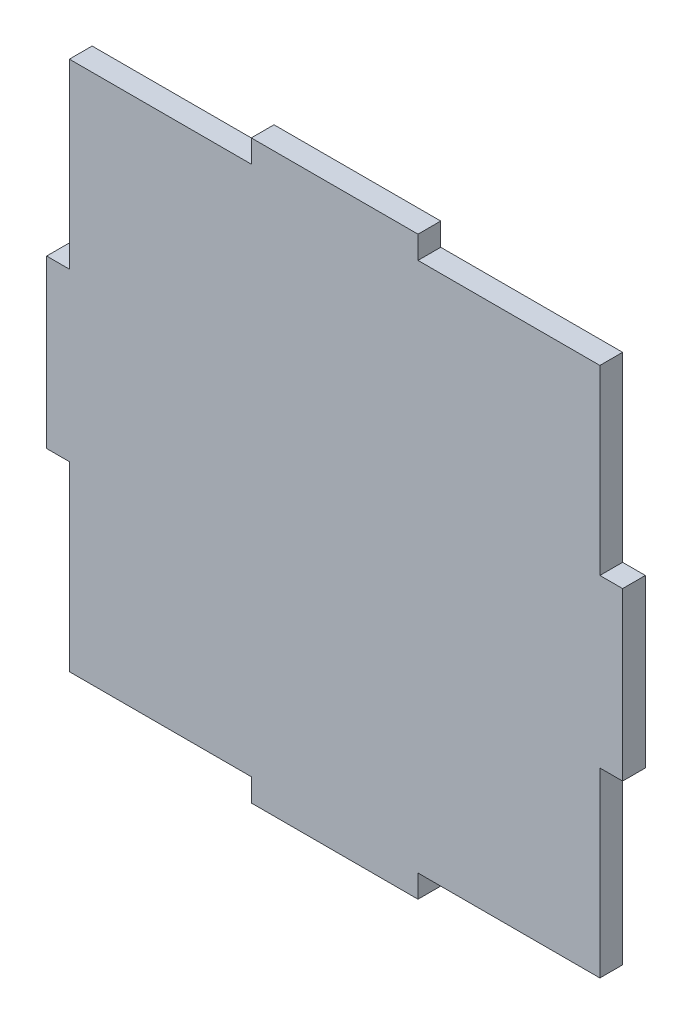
ISO-10303-21;
HEADER;
FILE_DESCRIPTION(('STEP AP214'),'2;1');
FILE_NAME('part.step','',(''),(''),'','','');
FILE_SCHEMA(('AUTOMOTIVE_DESIGN { 1 0 10303 214 1 1 1 1 }'));
ENDSEC;
DATA;
#1=APPLICATION_CONTEXT('core data for automotive mechanical design processes');
#2=APPLICATION_PROTOCOL_DEFINITION('international standard','automotive_design',2000,#1);
#3=PRODUCT_CONTEXT('',#1,'mechanical');
#4=PRODUCT('Part','Part','',(#3));
#5=PRODUCT_RELATED_PRODUCT_CATEGORY('part','',(#4));
#6=PRODUCT_DEFINITION_FORMATION('','',#4);
#7=PRODUCT_DEFINITION_CONTEXT('part definition',#1,'design');
#8=PRODUCT_DEFINITION('design','',#6,#7);
#9=PRODUCT_DEFINITION_SHAPE('','',#8);
#10=(LENGTH_UNIT() NAMED_UNIT(*) SI_UNIT(.MILLI.,.METRE.));
#11=(NAMED_UNIT(*) PLANE_ANGLE_UNIT() SI_UNIT($,.RADIAN.));
#12=(NAMED_UNIT(*) SI_UNIT($,.STERADIAN.) SOLID_ANGLE_UNIT());
#13=UNCERTAINTY_MEASURE_WITH_UNIT(LENGTH_MEASURE(1.E-05),#10,'distance_accuracy_value','');
#14=(GEOMETRIC_REPRESENTATION_CONTEXT(3) GLOBAL_UNCERTAINTY_ASSIGNED_CONTEXT((#13)) GLOBAL_UNIT_ASSIGNED_CONTEXT((#10,
#11,#12)) REPRESENTATION_CONTEXT('',''));
#15=CARTESIAN_POINT('',(0.,0.,0.));
#16=DIRECTION('',(0.,0.,1.));
#17=DIRECTION('',(1.,0.,0.));
#18=AXIS2_PLACEMENT_3D('',#15,#16,#17);
#19=CARTESIAN_POINT('',(-70.,70.,3.));
#20=DIRECTION('',(1.,0.,0.));
#21=DIRECTION('',(0.,1.,0.));
#22=AXIS2_PLACEMENT_3D('',#19,#20,#21);
#23=PLANE('',#22);
#24=DIRECTION('',(0.,-1.,0.));
#25=VECTOR('',#24,1.);
#26=CARTESIAN_POINT('',(-70.,70.,0.));
#27=LINE('',#26,#25);
#28=CARTESIAN_POINT('',(-70.,70.,0.));
#29=VERTEX_POINT('',#28);
#30=CARTESIAN_POINT('',(-70.,46.,0.));
#31=VERTEX_POINT('',#30);
#32=EDGE_CURVE('E201',#29,#31,#27,.T.);
#33=ORIENTED_EDGE('',*,*,#32,.T.);
#34=DIRECTION('',(0.,0.,-1.));
#35=VECTOR('',#34,1.);
#36=CARTESIAN_POINT('',(-70.,46.,3.));
#37=LINE('',#36,#35);
#38=CARTESIAN_POINT('',(-70.,46.,3.));
#39=VERTEX_POINT('',#38);
#40=EDGE_CURVE('E11',#39,#31,#37,.T.);
#41=ORIENTED_EDGE('',*,*,#40,.F.);
#42=DIRECTION('',(0.,-1.,0.));
#43=VECTOR('',#42,1.);
#44=CARTESIAN_POINT('',(-70.,70.,3.));
#45=LINE('',#44,#43);
#46=CARTESIAN_POINT('',(-70.,70.,3.));
#47=VERTEX_POINT('',#46);
#48=EDGE_CURVE('E239',#47,#39,#45,.T.);
#49=ORIENTED_EDGE('',*,*,#48,.F.);
#50=DIRECTION('',(0.,0.,-1.));
#51=VECTOR('',#50,1.);
#52=CARTESIAN_POINT('',(-70.,70.,3.));
#53=LINE('',#52,#51);
#54=EDGE_CURVE('E197',#47,#29,#53,.T.);
#55=ORIENTED_EDGE('',*,*,#54,.T.);
#56=EDGE_LOOP('',(#33,#41,#49,#55));
#57=FACE_BOUND('',#56,.T.);
#58=ADVANCED_FACE('F33',(#57),#23,.F.);
#59=CARTESIAN_POINT('',(-70.,46.,3.));
#60=DIRECTION('',(0.,-1.,0.));
#61=DIRECTION('',(1.,0.,0.));
#62=AXIS2_PLACEMENT_3D('',#59,#60,#61);
#63=PLANE('',#62);
#64=DIRECTION('',(-1.,0.,0.));
#65=VECTOR('',#64,1.);
#66=CARTESIAN_POINT('',(-70.,46.,0.));
#67=LINE('',#66,#65);
#68=CARTESIAN_POINT('',(-73.,46.,0.));
#69=VERTEX_POINT('',#68);
#70=EDGE_CURVE('E204',#31,#69,#67,.T.);
#71=ORIENTED_EDGE('',*,*,#70,.T.);
#72=DIRECTION('',(0.,0.,-1.));
#73=VECTOR('',#72,1.);
#74=CARTESIAN_POINT('',(-73.,46.,3.));
#75=LINE('',#74,#73);
#76=CARTESIAN_POINT('',(-73.,46.,3.));
#77=VERTEX_POINT('',#76);
#78=EDGE_CURVE('E41',#77,#69,#75,.T.);
#79=ORIENTED_EDGE('',*,*,#78,.F.);
#80=DIRECTION('',(-1.,0.,0.));
#81=VECTOR('',#80,1.);
#82=CARTESIAN_POINT('',(-70.,46.,3.));
#83=LINE('',#82,#81);
#84=EDGE_CURVE('E128',#39,#77,#83,.T.);
#85=ORIENTED_EDGE('',*,*,#84,.F.);
#86=ORIENTED_EDGE('',*,*,#40,.T.);
#87=EDGE_LOOP('',(#71,#79,#85,#86));
#88=FACE_BOUND('',#87,.T.);
#89=ADVANCED_FACE('F357',(#88),#63,.F.);
#90=CARTESIAN_POINT('',(-73.,46.,3.));
#91=DIRECTION('',(1.,0.,0.));
#92=DIRECTION('',(0.,1.,0.));
#93=AXIS2_PLACEMENT_3D('',#90,#91,#92);
#94=PLANE('',#93);
#95=DIRECTION('',(0.,-1.,0.));
#96=VECTOR('',#95,1.);
#97=CARTESIAN_POINT('',(-73.,46.,0.));
#98=LINE('',#97,#96);
#99=CARTESIAN_POINT('',(-73.,24.,0.));
#100=VERTEX_POINT('',#99);
#101=EDGE_CURVE('E206',#69,#100,#98,.T.);
#102=ORIENTED_EDGE('',*,*,#101,.T.);
#103=DIRECTION('',(0.,0.,-1.));
#104=VECTOR('',#103,1.);
#105=CARTESIAN_POINT('',(-73.,24.,3.));
#106=LINE('',#105,#104);
#107=CARTESIAN_POINT('',(-73.,24.,3.));
#108=VERTEX_POINT('',#107);
#109=EDGE_CURVE('E282',#108,#100,#106,.T.);
#110=ORIENTED_EDGE('',*,*,#109,.F.);
#111=DIRECTION('',(0.,-1.,0.));
#112=VECTOR('',#111,1.);
#113=CARTESIAN_POINT('',(-73.,46.,3.));
#114=LINE('',#113,#112);
#115=EDGE_CURVE('E290',#77,#108,#114,.T.);
#116=ORIENTED_EDGE('',*,*,#115,.F.);
#117=ORIENTED_EDGE('',*,*,#78,.T.);
#118=EDGE_LOOP('',(#102,#110,#116,#117));
#119=FACE_BOUND('',#118,.T.);
#120=ADVANCED_FACE('F288',(#119),#94,.F.);
#121=CARTESIAN_POINT('',(-70.,24.,3.));
#122=DIRECTION('',(0.,1.,0.));
#123=DIRECTION('',(0.,0.,1.));
#124=AXIS2_PLACEMENT_3D('',#121,#122,#123);
#125=PLANE('',#124);
#126=DIRECTION('',(1.,0.,0.));
#127=VECTOR('',#126,1.);
#128=CARTESIAN_POINT('',(-70.,24.,0.));
#129=LINE('',#128,#127);
#130=CARTESIAN_POINT('',(-70.,24.,0.));
#131=VERTEX_POINT('',#130);
#132=EDGE_CURVE('E208',#100,#131,#129,.T.);
#133=ORIENTED_EDGE('',*,*,#132,.T.);
#134=DIRECTION('',(0.,0.,-1.));
#135=VECTOR('',#134,1.);
#136=CARTESIAN_POINT('',(-70.,24.,3.));
#137=LINE('',#136,#135);
#138=CARTESIAN_POINT('',(-70.,24.,3.));
#139=VERTEX_POINT('',#138);
#140=EDGE_CURVE('E279',#139,#131,#137,.T.);
#141=ORIENTED_EDGE('',*,*,#140,.F.);
#142=DIRECTION('',(1.,0.,0.));
#143=VECTOR('',#142,1.);
#144=CARTESIAN_POINT('',(-70.,24.,3.));
#145=LINE('',#144,#143);
#146=EDGE_CURVE('E308',#108,#139,#145,.T.);
#147=ORIENTED_EDGE('',*,*,#146,.F.);
#148=ORIENTED_EDGE('',*,*,#109,.T.);
#149=EDGE_LOOP('',(#133,#141,#147,#148));
#150=FACE_BOUND('',#149,.T.);
#151=ADVANCED_FACE('F299',(#150),#125,.F.);
#152=CARTESIAN_POINT('',(-70.,24.,3.));
#153=DIRECTION('',(1.,0.,0.));
#154=DIRECTION('',(0.,1.,0.));
#155=AXIS2_PLACEMENT_3D('',#152,#153,#154);
#156=PLANE('',#155);
#157=DIRECTION('',(0.,-1.,0.));
#158=VECTOR('',#157,1.);
#159=CARTESIAN_POINT('',(-70.,24.,0.));
#160=LINE('',#159,#158);
#161=CARTESIAN_POINT('',(-70.,0.,0.));
#162=VERTEX_POINT('',#161);
#163=EDGE_CURVE('E210',#131,#162,#160,.T.);
#164=ORIENTED_EDGE('',*,*,#163,.T.);
#165=DIRECTION('',(0.,0.,-1.));
#166=VECTOR('',#165,1.);
#167=CARTESIAN_POINT('',(-70.,0.,3.));
#168=LINE('',#167,#166);
#169=CARTESIAN_POINT('',(-70.,0.,3.));
#170=VERTEX_POINT('',#169);
#171=EDGE_CURVE('E276',#170,#162,#168,.T.);
#172=ORIENTED_EDGE('',*,*,#171,.F.);
#173=DIRECTION('',(0.,-1.,0.));
#174=VECTOR('',#173,1.);
#175=CARTESIAN_POINT('',(-70.,24.,3.));
#176=LINE('',#175,#174);
#177=EDGE_CURVE('E305',#139,#170,#176,.T.);
#178=ORIENTED_EDGE('',*,*,#177,.F.);
#179=ORIENTED_EDGE('',*,*,#140,.T.);
#180=EDGE_LOOP('',(#164,#172,#178,#179));
#181=FACE_BOUND('',#180,.T.);
#182=ADVANCED_FACE('F303',(#181),#156,.F.);
#183=CARTESIAN_POINT('',(-70.,0.,3.));
#184=DIRECTION('',(0.,1.,0.));
#185=DIRECTION('',(0.,0.,1.));
#186=AXIS2_PLACEMENT_3D('',#183,#184,#185);
#187=PLANE('',#186);
#188=DIRECTION('',(1.,0.,0.));
#189=VECTOR('',#188,1.);
#190=CARTESIAN_POINT('',(-70.,0.,0.));
#191=LINE('',#190,#189);
#192=CARTESIAN_POINT('',(-46.,0.,0.));
#193=VERTEX_POINT('',#192);
#194=EDGE_CURVE('E212',#162,#193,#191,.T.);
#195=ORIENTED_EDGE('',*,*,#194,.T.);
#196=DIRECTION('',(0.,0.,-1.));
#197=VECTOR('',#196,1.);
#198=CARTESIAN_POINT('',(-46.,0.,3.));
#199=LINE('',#198,#197);
#200=CARTESIAN_POINT('',(-46.,0.,3.));
#201=VERTEX_POINT('',#200);
#202=EDGE_CURVE('E273',#201,#193,#199,.T.);
#203=ORIENTED_EDGE('',*,*,#202,.F.);
#204=DIRECTION('',(1.,0.,0.));
#205=VECTOR('',#204,1.);
#206=CARTESIAN_POINT('',(-70.,0.,3.));
#207=LINE('',#206,#205);
#208=EDGE_CURVE('E307',#170,#201,#207,.T.);
#209=ORIENTED_EDGE('',*,*,#208,.F.);
#210=ORIENTED_EDGE('',*,*,#171,.T.);
#211=EDGE_LOOP('',(#195,#203,#209,#210));
#212=FACE_BOUND('',#211,.T.);
#213=ADVANCED_FACE('F370',(#212),#187,.F.);
#214=CARTESIAN_POINT('',(-46.,0.,3.));
#215=DIRECTION('',(1.,0.,0.));
#216=DIRECTION('',(0.,0.,-1.));
#217=AXIS2_PLACEMENT_3D('',#214,#215,#216);
#218=PLANE('',#217);
#219=DIRECTION('',(0.,-1.,0.));
#220=VECTOR('',#219,1.);
#221=CARTESIAN_POINT('',(-46.,0.,0.));
#222=LINE('',#221,#220);
#223=CARTESIAN_POINT('',(-46.,-3.,0.));
#224=VERTEX_POINT('',#223);
#225=EDGE_CURVE('E214',#193,#224,#222,.T.);
#226=ORIENTED_EDGE('',*,*,#225,.T.);
#227=DIRECTION('',(0.,0.,-1.));
#228=VECTOR('',#227,1.);
#229=CARTESIAN_POINT('',(-46.,-3.,3.));
#230=LINE('',#229,#228);
#231=CARTESIAN_POINT('',(-46.,-3.,3.));
#232=VERTEX_POINT('',#231);
#233=EDGE_CURVE('E270',#232,#224,#230,.T.);
#234=ORIENTED_EDGE('',*,*,#233,.F.);
#235=DIRECTION('',(0.,-1.,0.));
#236=VECTOR('',#235,1.);
#237=CARTESIAN_POINT('',(-46.,0.,3.));
#238=LINE('',#237,#236);
#239=EDGE_CURVE('E310',#201,#232,#238,.T.);
#240=ORIENTED_EDGE('',*,*,#239,.F.);
#241=ORIENTED_EDGE('',*,*,#202,.T.);
#242=EDGE_LOOP('',(#226,#234,#240,#241));
#243=FACE_BOUND('',#242,.T.);
#244=ADVANCED_FACE('F373',(#243),#218,.F.);
#245=CARTESIAN_POINT('',(-46.,-3.,3.));
#246=DIRECTION('',(0.,1.,0.));
#247=DIRECTION('',(0.,0.,1.));
#248=AXIS2_PLACEMENT_3D('',#245,#246,#247);
#249=PLANE('',#248);
#250=DIRECTION('',(1.,0.,0.));
#251=VECTOR('',#250,1.);
#252=CARTESIAN_POINT('',(-46.,-3.,0.));
#253=LINE('',#252,#251);
#254=CARTESIAN_POINT('',(-24.,-3.,0.));
#255=VERTEX_POINT('',#254);
#256=EDGE_CURVE('E216',#224,#255,#253,.T.);
#257=ORIENTED_EDGE('',*,*,#256,.T.);
#258=DIRECTION('',(0.,0.,-1.));
#259=VECTOR('',#258,1.);
#260=CARTESIAN_POINT('',(-24.,-3.,3.));
#261=LINE('',#260,#259);
#262=CARTESIAN_POINT('',(-24.,-3.,3.));
#263=VERTEX_POINT('',#262);
#264=EDGE_CURVE('E267',#263,#255,#261,.T.);
#265=ORIENTED_EDGE('',*,*,#264,.F.);
#266=DIRECTION('',(1.,0.,0.));
#267=VECTOR('',#266,1.);
#268=CARTESIAN_POINT('',(-46.,-3.,3.));
#269=LINE('',#268,#267);
#270=EDGE_CURVE('E316',#232,#263,#269,.T.);
#271=ORIENTED_EDGE('',*,*,#270,.F.);
#272=ORIENTED_EDGE('',*,*,#233,.T.);
#273=EDGE_LOOP('',(#257,#265,#271,#272));
#274=FACE_BOUND('',#273,.T.);
#275=ADVANCED_FACE('F377',(#274),#249,.F.);
#276=CARTESIAN_POINT('',(-24.,0.,3.));
#277=DIRECTION('',(-1.,0.,0.));
#278=DIRECTION('',(0.,0.,1.));
#279=AXIS2_PLACEMENT_3D('',#276,#277,#278);
#280=PLANE('',#279);
#281=DIRECTION('',(0.,1.,0.));
#282=VECTOR('',#281,1.);
#283=CARTESIAN_POINT('',(-24.,0.,0.));
#284=LINE('',#283,#282);
#285=CARTESIAN_POINT('',(-24.,0.,0.));
#286=VERTEX_POINT('',#285);
#287=EDGE_CURVE('E218',#255,#286,#284,.T.);
#288=ORIENTED_EDGE('',*,*,#287,.T.);
#289=DIRECTION('',(0.,0.,-1.));
#290=VECTOR('',#289,1.);
#291=CARTESIAN_POINT('',(-24.,0.,3.));
#292=LINE('',#291,#290);
#293=CARTESIAN_POINT('',(-24.,0.,3.));
#294=VERTEX_POINT('',#293);
#295=EDGE_CURVE('E264',#294,#286,#292,.T.);
#296=ORIENTED_EDGE('',*,*,#295,.F.);
#297=DIRECTION('',(0.,1.,0.));
#298=VECTOR('',#297,1.);
#299=CARTESIAN_POINT('',(-24.,0.,3.));
#300=LINE('',#299,#298);
#301=EDGE_CURVE('E318',#263,#294,#300,.T.);
#302=ORIENTED_EDGE('',*,*,#301,.F.);
#303=ORIENTED_EDGE('',*,*,#264,.T.);
#304=EDGE_LOOP('',(#288,#296,#302,#303));
#305=FACE_BOUND('',#304,.T.);
#306=ADVANCED_FACE('F381',(#305),#280,.F.);
#307=CARTESIAN_POINT('',(-24.,0.,3.));
#308=DIRECTION('',(0.,1.,0.));
#309=DIRECTION('',(0.,0.,1.));
#310=AXIS2_PLACEMENT_3D('',#307,#308,#309);
#311=PLANE('',#310);
#312=DIRECTION('',(1.,0.,0.));
#313=VECTOR('',#312,1.);
#314=CARTESIAN_POINT('',(-24.,0.,0.));
#315=LINE('',#314,#313);
#316=CARTESIAN_POINT('',(0.,0.,0.));
#317=VERTEX_POINT('',#316);
#318=EDGE_CURVE('E220',#286,#317,#315,.T.);
#319=ORIENTED_EDGE('',*,*,#318,.T.);
#320=DIRECTION('',(0.,0.,-1.));
#321=VECTOR('',#320,1.);
#322=CARTESIAN_POINT('',(0.,0.,3.));
#323=LINE('',#322,#321);
#324=CARTESIAN_POINT('',(0.,0.,3.));
#325=VERTEX_POINT('',#324);
#326=EDGE_CURVE('E261',#325,#317,#323,.T.);
#327=ORIENTED_EDGE('',*,*,#326,.F.);
#328=DIRECTION('',(1.,0.,0.));
#329=VECTOR('',#328,1.);
#330=CARTESIAN_POINT('',(-24.,0.,3.));
#331=LINE('',#330,#329);
#332=EDGE_CURVE('E320',#294,#325,#331,.T.);
#333=ORIENTED_EDGE('',*,*,#332,.F.);
#334=ORIENTED_EDGE('',*,*,#295,.T.);
#335=EDGE_LOOP('',(#319,#327,#333,#334));
#336=FACE_BOUND('',#335,.T.);
#337=ADVANCED_FACE('F385',(#336),#311,.F.);
#338=CARTESIAN_POINT('',(0.,24.,3.));
#339=DIRECTION('',(-1.,0.,0.));
#340=DIRECTION('',(0.,-1.,0.));
#341=AXIS2_PLACEMENT_3D('',#338,#339,#340);
#342=PLANE('',#341);
#343=DIRECTION('',(0.,1.,0.));
#344=VECTOR('',#343,1.);
#345=CARTESIAN_POINT('',(0.,24.,0.));
#346=LINE('',#345,#344);
#347=CARTESIAN_POINT('',(0.,24.,0.));
#348=VERTEX_POINT('',#347);
#349=EDGE_CURVE('E222',#317,#348,#346,.T.);
#350=ORIENTED_EDGE('',*,*,#349,.T.);
#351=DIRECTION('',(0.,0.,-1.));
#352=VECTOR('',#351,1.);
#353=CARTESIAN_POINT('',(0.,24.,3.));
#354=LINE('',#353,#352);
#355=CARTESIAN_POINT('',(0.,24.,3.));
#356=VERTEX_POINT('',#355);
#357=EDGE_CURVE('E258',#356,#348,#354,.T.);
#358=ORIENTED_EDGE('',*,*,#357,.F.);
#359=DIRECTION('',(0.,1.,0.));
#360=VECTOR('',#359,1.);
#361=CARTESIAN_POINT('',(0.,24.,3.));
#362=LINE('',#361,#360);
#363=EDGE_CURVE('E322',#325,#356,#362,.T.);
#364=ORIENTED_EDGE('',*,*,#363,.F.);
#365=ORIENTED_EDGE('',*,*,#326,.T.);
#366=EDGE_LOOP('',(#350,#358,#364,#365));
#367=FACE_BOUND('',#366,.T.);
#368=ADVANCED_FACE('F389',(#367),#342,.F.);
#369=CARTESIAN_POINT('',(0.,24.,3.));
#370=DIRECTION('',(0.,1.,0.));
#371=DIRECTION('',(0.,0.,1.));
#372=AXIS2_PLACEMENT_3D('',#369,#370,#371);
#373=PLANE('',#372);
#374=DIRECTION('',(1.,0.,0.));
#375=VECTOR('',#374,1.);
#376=CARTESIAN_POINT('',(0.,24.,0.));
#377=LINE('',#376,#375);
#378=CARTESIAN_POINT('',(3.00000000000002,24.,0.));
#379=VERTEX_POINT('',#378);
#380=EDGE_CURVE('E224',#348,#379,#377,.T.);
#381=ORIENTED_EDGE('',*,*,#380,.T.);
#382=DIRECTION('',(0.,0.,-1.));
#383=VECTOR('',#382,1.);
#384=CARTESIAN_POINT('',(3.00000000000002,24.,3.));
#385=LINE('',#384,#383);
#386=CARTESIAN_POINT('',(3.00000000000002,24.,3.));
#387=VERTEX_POINT('',#386);
#388=EDGE_CURVE('E255',#387,#379,#385,.T.);
#389=ORIENTED_EDGE('',*,*,#388,.F.);
#390=DIRECTION('',(1.,0.,0.));
#391=VECTOR('',#390,1.);
#392=CARTESIAN_POINT('',(0.,24.,3.));
#393=LINE('',#392,#391);
#394=EDGE_CURVE('E324',#356,#387,#393,.T.);
#395=ORIENTED_EDGE('',*,*,#394,.F.);
#396=ORIENTED_EDGE('',*,*,#357,.T.);
#397=EDGE_LOOP('',(#381,#389,#395,#396));
#398=FACE_BOUND('',#397,.T.);
#399=ADVANCED_FACE('F393',(#398),#373,.F.);
#400=CARTESIAN_POINT('',(3.,46.,3.));
#401=DIRECTION('',(-1.,0.,0.));
#402=DIRECTION('',(0.,-1.,0.));
#403=AXIS2_PLACEMENT_3D('',#400,#401,#402);
#404=PLANE('',#403);
#405=DIRECTION('',(0.,1.,0.));
#406=VECTOR('',#405,1.);
#407=CARTESIAN_POINT('',(3.,46.,0.));
#408=LINE('',#407,#406);
#409=CARTESIAN_POINT('',(3.,46.,0.));
#410=VERTEX_POINT('',#409);
#411=EDGE_CURVE('E226',#379,#410,#408,.T.);
#412=ORIENTED_EDGE('',*,*,#411,.T.);
#413=DIRECTION('',(0.,0.,-1.));
#414=VECTOR('',#413,1.);
#415=CARTESIAN_POINT('',(3.,46.,3.));
#416=LINE('',#415,#414);
#417=CARTESIAN_POINT('',(3.,46.,3.));
#418=VERTEX_POINT('',#417);
#419=EDGE_CURVE('E252',#418,#410,#416,.T.);
#420=ORIENTED_EDGE('',*,*,#419,.F.);
#421=DIRECTION('',(0.,1.,0.));
#422=VECTOR('',#421,1.);
#423=CARTESIAN_POINT('',(3.,46.,3.));
#424=LINE('',#423,#422);
#425=EDGE_CURVE('E326',#387,#418,#424,.T.);
#426=ORIENTED_EDGE('',*,*,#425,.F.);
#427=ORIENTED_EDGE('',*,*,#388,.T.);
#428=EDGE_LOOP('',(#412,#420,#426,#427));
#429=FACE_BOUND('',#428,.T.);
#430=ADVANCED_FACE('F397',(#429),#404,.F.);
#431=CARTESIAN_POINT('',(0.,46.,3.));
#432=DIRECTION('',(0.,-1.,0.));
#433=DIRECTION('',(1.,0.,0.));
#434=AXIS2_PLACEMENT_3D('',#431,#432,#433);
#435=PLANE('',#434);
#436=DIRECTION('',(-1.,0.,0.));
#437=VECTOR('',#436,1.);
#438=CARTESIAN_POINT('',(0.,46.,0.));
#439=LINE('',#438,#437);
#440=CARTESIAN_POINT('',(0.,46.,0.));
#441=VERTEX_POINT('',#440);
#442=EDGE_CURVE('E228',#410,#441,#439,.T.);
#443=ORIENTED_EDGE('',*,*,#442,.T.);
#444=DIRECTION('',(0.,0.,-1.));
#445=VECTOR('',#444,1.);
#446=CARTESIAN_POINT('',(0.,46.,3.));
#447=LINE('',#446,#445);
#448=CARTESIAN_POINT('',(0.,46.,3.));
#449=VERTEX_POINT('',#448);
#450=EDGE_CURVE('E249',#449,#441,#447,.T.);
#451=ORIENTED_EDGE('',*,*,#450,.F.);
#452=DIRECTION('',(-1.,0.,0.));
#453=VECTOR('',#452,1.);
#454=CARTESIAN_POINT('',(0.,46.,3.));
#455=LINE('',#454,#453);
#456=EDGE_CURVE('E328',#418,#449,#455,.T.);
#457=ORIENTED_EDGE('',*,*,#456,.F.);
#458=ORIENTED_EDGE('',*,*,#419,.T.);
#459=EDGE_LOOP('',(#443,#451,#457,#458));
#460=FACE_BOUND('',#459,.T.);
#461=ADVANCED_FACE('F401',(#460),#435,.F.);
#462=CARTESIAN_POINT('',(0.,70.,3.));
#463=DIRECTION('',(-1.,0.,0.));
#464=DIRECTION('',(0.,-1.,0.));
#465=AXIS2_PLACEMENT_3D('',#462,#463,#464);
#466=PLANE('',#465);
#467=DIRECTION('',(0.,1.,0.));
#468=VECTOR('',#467,1.);
#469=CARTESIAN_POINT('',(0.,70.,0.));
#470=LINE('',#469,#468);
#471=CARTESIAN_POINT('',(0.,70.,0.));
#472=VERTEX_POINT('',#471);
#473=EDGE_CURVE('E230',#441,#472,#470,.T.);
#474=ORIENTED_EDGE('',*,*,#473,.T.);
#475=DIRECTION('',(0.,0.,-1.));
#476=VECTOR('',#475,1.);
#477=CARTESIAN_POINT('',(0.,70.,3.));
#478=LINE('',#477,#476);
#479=CARTESIAN_POINT('',(0.,70.,3.));
#480=VERTEX_POINT('',#479);
#481=EDGE_CURVE('E246',#480,#472,#478,.T.);
#482=ORIENTED_EDGE('',*,*,#481,.F.);
#483=DIRECTION('',(0.,1.,0.));
#484=VECTOR('',#483,1.);
#485=CARTESIAN_POINT('',(0.,70.,3.));
#486=LINE('',#485,#484);
#487=EDGE_CURVE('E330',#449,#480,#486,.T.);
#488=ORIENTED_EDGE('',*,*,#487,.F.);
#489=ORIENTED_EDGE('',*,*,#450,.T.);
#490=EDGE_LOOP('',(#474,#482,#488,#489));
#491=FACE_BOUND('',#490,.T.);
#492=ADVANCED_FACE('F405',(#491),#466,.F.);
#493=CARTESIAN_POINT('',(-24.,70.,3.));
#494=DIRECTION('',(0.,-1.,0.));
#495=DIRECTION('',(1.,0.,0.));
#496=AXIS2_PLACEMENT_3D('',#493,#494,#495);
#497=PLANE('',#496);
#498=DIRECTION('',(-1.,0.,0.));
#499=VECTOR('',#498,1.);
#500=CARTESIAN_POINT('',(-24.,70.,0.));
#501=LINE('',#500,#499);
#502=CARTESIAN_POINT('',(-24.,70.,0.));
#503=VERTEX_POINT('',#502);
#504=EDGE_CURVE('E232',#472,#503,#501,.T.);
#505=ORIENTED_EDGE('',*,*,#504,.T.);
#506=DIRECTION('',(0.,0.,-1.));
#507=VECTOR('',#506,1.);
#508=CARTESIAN_POINT('',(-24.,70.,3.));
#509=LINE('',#508,#507);
#510=CARTESIAN_POINT('',(-24.,70.,3.));
#511=VERTEX_POINT('',#510);
#512=EDGE_CURVE('E243',#511,#503,#509,.T.);
#513=ORIENTED_EDGE('',*,*,#512,.F.);
#514=DIRECTION('',(-1.,0.,0.));
#515=VECTOR('',#514,1.);
#516=CARTESIAN_POINT('',(-24.,70.,3.));
#517=LINE('',#516,#515);
#518=EDGE_CURVE('E332',#480,#511,#517,.T.);
#519=ORIENTED_EDGE('',*,*,#518,.F.);
#520=ORIENTED_EDGE('',*,*,#481,.T.);
#521=EDGE_LOOP('',(#505,#513,#519,#520));
#522=FACE_BOUND('',#521,.T.);
#523=ADVANCED_FACE('F338',(#522),#497,.F.);
#524=CARTESIAN_POINT('',(-24.,70.,3.));
#525=DIRECTION('',(-1.,0.,0.));
#526=DIRECTION('',(0.,0.,1.));
#527=AXIS2_PLACEMENT_3D('',#524,#525,#526);
#528=PLANE('',#527);
#529=DIRECTION('',(0.,1.,0.));
#530=VECTOR('',#529,1.);
#531=CARTESIAN_POINT('',(-24.,70.,0.));
#532=LINE('',#531,#530);
#533=CARTESIAN_POINT('',(-24.,73.,0.));
#534=VERTEX_POINT('',#533);
#535=EDGE_CURVE('E234',#503,#534,#532,.T.);
#536=ORIENTED_EDGE('',*,*,#535,.T.);
#537=DIRECTION('',(0.,0.,-1.));
#538=VECTOR('',#537,1.);
#539=CARTESIAN_POINT('',(-24.,73.,3.));
#540=LINE('',#539,#538);
#541=CARTESIAN_POINT('',(-24.,73.,3.));
#542=VERTEX_POINT('',#541);
#543=EDGE_CURVE('E192',#542,#534,#540,.T.);
#544=ORIENTED_EDGE('',*,*,#543,.F.);
#545=DIRECTION('',(0.,1.,0.));
#546=VECTOR('',#545,1.);
#547=CARTESIAN_POINT('',(-24.,70.,3.));
#548=LINE('',#547,#546);
#549=EDGE_CURVE('E183',#511,#542,#548,.T.);
#550=ORIENTED_EDGE('',*,*,#549,.F.);
#551=ORIENTED_EDGE('',*,*,#512,.T.);
#552=EDGE_LOOP('',(#536,#544,#550,#551));
#553=FACE_BOUND('',#552,.T.);
#554=ADVANCED_FACE('F342',(#553),#528,.F.);
#555=CARTESIAN_POINT('',(-46.,73.,3.));
#556=DIRECTION('',(0.,-1.,0.));
#557=DIRECTION('',(0.,0.,-1.));
#558=AXIS2_PLACEMENT_3D('',#555,#556,#557);
#559=PLANE('',#558);
#560=DIRECTION('',(-1.,0.,0.));
#561=VECTOR('',#560,1.);
#562=CARTESIAN_POINT('',(-46.,73.,0.));
#563=LINE('',#562,#561);
#564=CARTESIAN_POINT('',(-46.,73.,0.));
#565=VERTEX_POINT('',#564);
#566=EDGE_CURVE('E191',#534,#565,#563,.T.);
#567=ORIENTED_EDGE('',*,*,#566,.T.);
#568=DIRECTION('',(0.,0.,-1.));
#569=VECTOR('',#568,1.);
#570=CARTESIAN_POINT('',(-46.,73.,3.));
#571=LINE('',#570,#569);
#572=CARTESIAN_POINT('',(-46.,73.,3.));
#573=VERTEX_POINT('',#572);
#574=EDGE_CURVE('E188',#573,#565,#571,.T.);
#575=ORIENTED_EDGE('',*,*,#574,.F.);
#576=DIRECTION('',(-1.,0.,0.));
#577=VECTOR('',#576,1.);
#578=CARTESIAN_POINT('',(-46.,73.,3.));
#579=LINE('',#578,#577);
#580=EDGE_CURVE('E177',#542,#573,#579,.T.);
#581=ORIENTED_EDGE('',*,*,#580,.F.);
#582=ORIENTED_EDGE('',*,*,#543,.T.);
#583=EDGE_LOOP('',(#567,#575,#581,#582));
#584=FACE_BOUND('',#583,.T.);
#585=ADVANCED_FACE('F189',(#584),#559,.F.);
#586=CARTESIAN_POINT('',(-46.,70.,3.));
#587=DIRECTION('',(1.,0.,0.));
#588=DIRECTION('',(0.,0.,-1.));
#589=AXIS2_PLACEMENT_3D('',#586,#587,#588);
#590=PLANE('',#589);
#591=DIRECTION('',(0.,-1.,0.));
#592=VECTOR('',#591,1.);
#593=CARTESIAN_POINT('',(-46.,70.,0.));
#594=LINE('',#593,#592);
#595=CARTESIAN_POINT('',(-46.,70.,0.));
#596=VERTEX_POINT('',#595);
#597=EDGE_CURVE('E114',#565,#596,#594,.T.);
#598=ORIENTED_EDGE('',*,*,#597,.T.);
#599=DIRECTION('',(0.,0.,-1.));
#600=VECTOR('',#599,1.);
#601=CARTESIAN_POINT('',(-46.,70.,3.));
#602=LINE('',#601,#600);
#603=CARTESIAN_POINT('',(-46.,70.,3.));
#604=VERTEX_POINT('',#603);
#605=EDGE_CURVE('E193',#604,#596,#602,.T.);
#606=ORIENTED_EDGE('',*,*,#605,.F.);
#607=DIRECTION('',(0.,-1.,0.));
#608=VECTOR('',#607,1.);
#609=CARTESIAN_POINT('',(-46.,70.,3.));
#610=LINE('',#609,#608);
#611=EDGE_CURVE('E181',#573,#604,#610,.T.);
#612=ORIENTED_EDGE('',*,*,#611,.F.);
#613=ORIENTED_EDGE('',*,*,#574,.T.);
#614=EDGE_LOOP('',(#598,#606,#612,#613));
#615=FACE_BOUND('',#614,.T.);
#616=ADVANCED_FACE('F195',(#615),#590,.F.);
#617=CARTESIAN_POINT('',(-70.,70.,3.));
#618=DIRECTION('',(0.,-1.,0.));
#619=DIRECTION('',(0.,0.,-1.));
#620=AXIS2_PLACEMENT_3D('',#617,#618,#619);
#621=PLANE('',#620);
#622=DIRECTION('',(-1.,0.,0.));
#623=VECTOR('',#622,1.);
#624=CARTESIAN_POINT('',(-70.,70.,0.));
#625=LINE('',#624,#623);
#626=EDGE_CURVE('E120',#596,#29,#625,.T.);
#627=ORIENTED_EDGE('',*,*,#626,.T.);
#628=ORIENTED_EDGE('',*,*,#54,.F.);
#629=DIRECTION('',(-1.,0.,0.));
#630=VECTOR('',#629,1.);
#631=CARTESIAN_POINT('',(-70.,70.,3.));
#632=LINE('',#631,#630);
#633=EDGE_CURVE('E49',#604,#47,#632,.T.);
#634=ORIENTED_EDGE('',*,*,#633,.F.);
#635=ORIENTED_EDGE('',*,*,#605,.T.);
#636=EDGE_LOOP('',(#627,#628,#634,#635));
#637=FACE_BOUND('',#636,.T.);
#638=ADVANCED_FACE('F346',(#637),#621,.F.);
#639=CARTESIAN_POINT('',(0.,0.,3.));
#640=DIRECTION('',(0.,0.,-1.));
#641=DIRECTION('',(-1.,0.,0.));
#642=AXIS2_PLACEMENT_3D('',#639,#640,#641);
#643=PLANE('',#642);
#644=ORIENTED_EDGE('',*,*,#48,.T.);
#645=ORIENTED_EDGE('',*,*,#84,.T.);
#646=ORIENTED_EDGE('',*,*,#115,.T.);
#647=ORIENTED_EDGE('',*,*,#146,.T.);
#648=ORIENTED_EDGE('',*,*,#177,.T.);
#649=ORIENTED_EDGE('',*,*,#208,.T.);
#650=ORIENTED_EDGE('',*,*,#239,.T.);
#651=ORIENTED_EDGE('',*,*,#270,.T.);
#652=ORIENTED_EDGE('',*,*,#301,.T.);
#653=ORIENTED_EDGE('',*,*,#332,.T.);
#654=ORIENTED_EDGE('',*,*,#363,.T.);
#655=ORIENTED_EDGE('',*,*,#394,.T.);
#656=ORIENTED_EDGE('',*,*,#425,.T.);
#657=ORIENTED_EDGE('',*,*,#456,.T.);
#658=ORIENTED_EDGE('',*,*,#487,.T.);
#659=ORIENTED_EDGE('',*,*,#518,.T.);
#660=ORIENTED_EDGE('',*,*,#549,.T.);
#661=ORIENTED_EDGE('',*,*,#580,.T.);
#662=ORIENTED_EDGE('',*,*,#611,.T.);
#663=ORIENTED_EDGE('',*,*,#633,.T.);
#664=EDGE_LOOP('',(#644,#645,#646,#647,#648,#649,#650,#651,#652,#653,#654,#655,#656,#657,#658,
#659,#660,#661,#662,#663));
#665=FACE_BOUND('',#664,.T.);
#666=ADVANCED_FACE('F179',(#665),#643,.F.);
#667=CARTESIAN_POINT('',(0.,0.,0.));
#668=DIRECTION('',(0.,0.,-1.));
#669=DIRECTION('',(-1.,0.,0.));
#670=AXIS2_PLACEMENT_3D('',#667,#668,#669);
#671=PLANE('',#670);
#672=ORIENTED_EDGE('',*,*,#32,.F.);
#673=ORIENTED_EDGE('',*,*,#626,.F.);
#674=ORIENTED_EDGE('',*,*,#597,.F.);
#675=ORIENTED_EDGE('',*,*,#566,.F.);
#676=ORIENTED_EDGE('',*,*,#535,.F.);
#677=ORIENTED_EDGE('',*,*,#504,.F.);
#678=ORIENTED_EDGE('',*,*,#473,.F.);
#679=ORIENTED_EDGE('',*,*,#442,.F.);
#680=ORIENTED_EDGE('',*,*,#411,.F.);
#681=ORIENTED_EDGE('',*,*,#380,.F.);
#682=ORIENTED_EDGE('',*,*,#349,.F.);
#683=ORIENTED_EDGE('',*,*,#318,.F.);
#684=ORIENTED_EDGE('',*,*,#287,.F.);
#685=ORIENTED_EDGE('',*,*,#256,.F.);
#686=ORIENTED_EDGE('',*,*,#225,.F.);
#687=ORIENTED_EDGE('',*,*,#194,.F.);
#688=ORIENTED_EDGE('',*,*,#163,.F.);
#689=ORIENTED_EDGE('',*,*,#132,.F.);
#690=ORIENTED_EDGE('',*,*,#101,.F.);
#691=ORIENTED_EDGE('',*,*,#70,.F.);
#692=EDGE_LOOP('',(#672,#673,#674,#675,#676,#677,#678,#679,#680,#681,#682,#683,#684,#685,#686,
#687,#688,#689,#690,#691));
#693=FACE_BOUND('',#692,.T.);
#694=ADVANCED_FACE('F294',(#693),#671,.T.);
#695=CLOSED_SHELL('',(#58,#89,#120,#151,#182,#213,#244,#275,#306,#337,#368,#399,#430,#461,#492,
#523,#554,#585,#616,#638,#666,#694));
#696=MANIFOLD_SOLID_BREP('B2',#695);
#697=ADVANCED_BREP_SHAPE_REPRESENTATION('',(#18,#696),#14);
#698=SHAPE_DEFINITION_REPRESENTATION(#9,#697);
ENDSEC;
END-ISO-10303-21;
